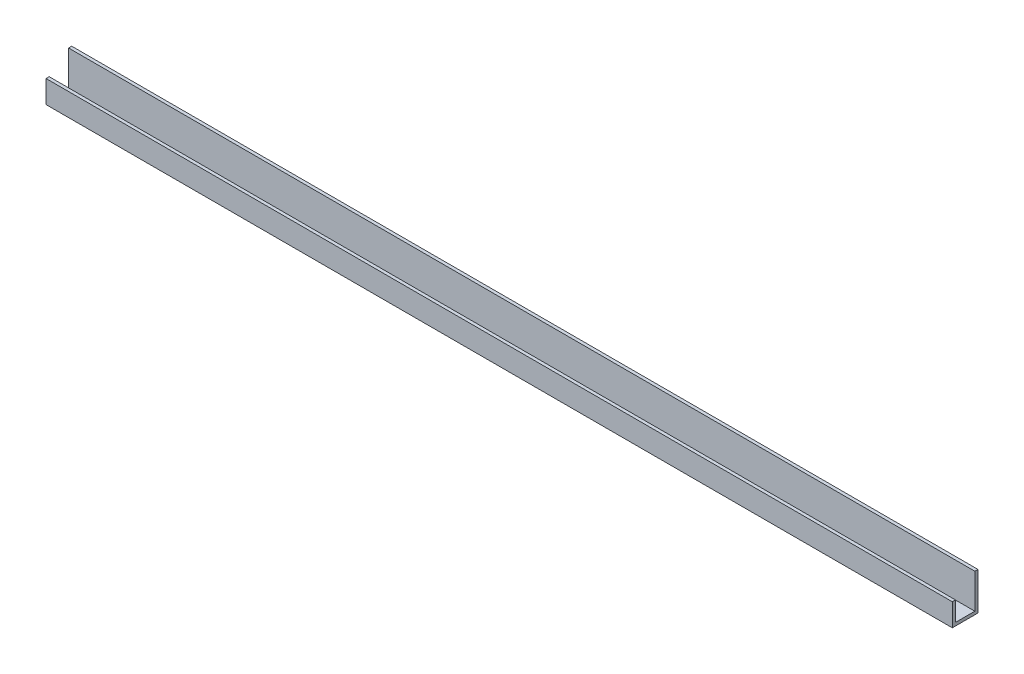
from build123d import *

# Parameters (mm, degrees)
SKETCH1_W           = 457.2
SKETCH1_H           = 12.954
BOSS_EXTRUDE1_DEPTH = 19.05
SKETCH2_W           = 457.2
SKETCH2_H           = 9.779
CUT_EXTRUDE1_DEPTH  = 17.4625
CUT_EXTRUDE2_REACH  = 459.78
SKETCH3_W           = 457.2
SKETCH3_H           = 7.6454


with BuildPart() as part:
    # Sketch1 → Boss-Extrude1 (new body)
    with BuildSketch(Plane(origin=(0, 0, 0), x_dir=(1, 0, 0), z_dir=(0, 1, 0))):
        with Locations((228.6, -6.477)):
            Rectangle(SKETCH1_W, SKETCH1_H)
    extrude(amount=BOSS_EXTRUDE1_DEPTH)

    # Sketch2 → Cut-Extrude1 (cut)
    with BuildSketch(Plane(origin=(0, 19.05, 0), x_dir=(1, 0, 0), z_dir=(0, 1, 0))):
        with Locations((228.6, -6.477)):
            Rectangle(SKETCH2_W, SKETCH2_H)
    extrude(amount=-CUT_EXTRUDE1_DEPTH, mode=Mode.SUBTRACT)

    # Sketch3 → Cut-Extrude2 (cut, up to next)
    with BuildSketch(Plane.XY.offset(12.954), mode=Mode.PRIVATE) as cut_extrude2_sk1:
        with Locations((228.6, 15.2273)):
            Rectangle(SKETCH3_W, SKETCH3_H)
    cut_extrude2_tool1 = extrude(cut_extrude2_sk1.sketch, amount=-CUT_EXTRUDE2_REACH, mode=Mode.PRIVATE) & part.part
    add(cut_extrude2_tool1.solids().sort_by_distance((228.6, 15.2273, 12.954))[0], mode=Mode.SUBTRACT)


solid = part.part
